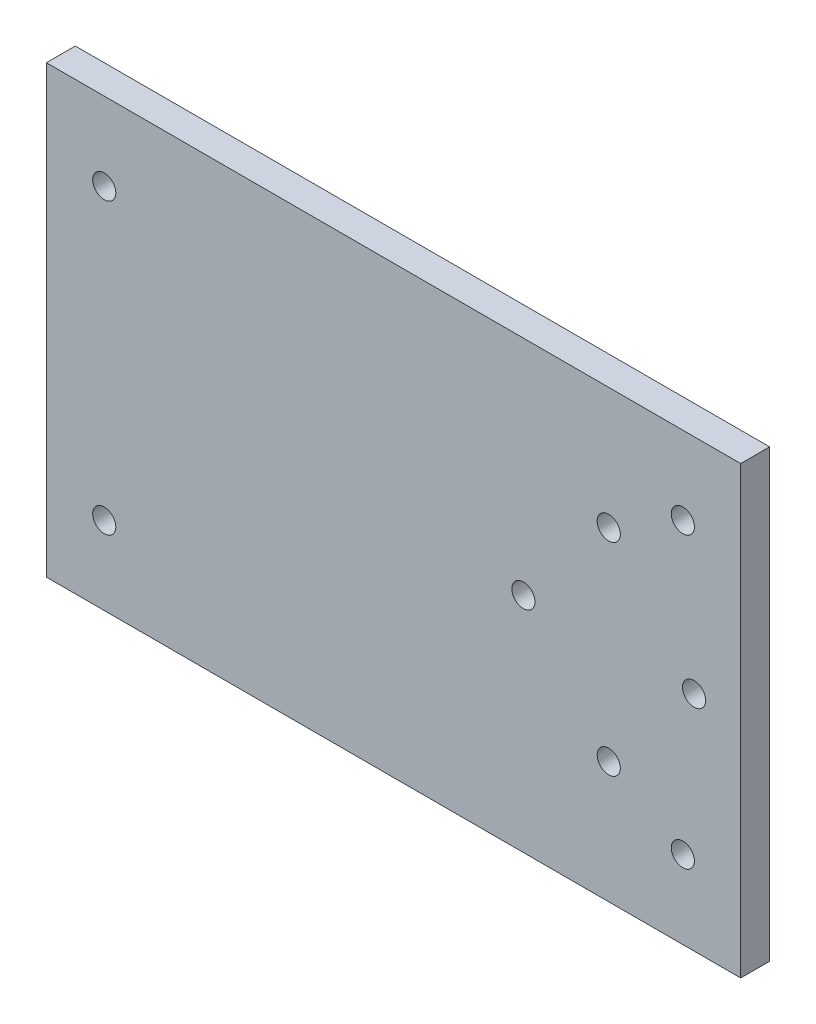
ISO-10303-21;
HEADER;
FILE_DESCRIPTION(('STEP AP214'),'2;1');
FILE_NAME('part.step','',(''),(''),'','','');
FILE_SCHEMA(('AUTOMOTIVE_DESIGN { 1 0 10303 214 1 1 1 1 }'));
ENDSEC;
DATA;
#1=APPLICATION_CONTEXT('core data for automotive mechanical design processes');
#2=APPLICATION_PROTOCOL_DEFINITION('international standard','automotive_design',2000,#1);
#3=PRODUCT_CONTEXT('',#1,'mechanical');
#4=PRODUCT('Part','Part','',(#3));
#5=PRODUCT_RELATED_PRODUCT_CATEGORY('part','',(#4));
#6=PRODUCT_DEFINITION_FORMATION('','',#4);
#7=PRODUCT_DEFINITION_CONTEXT('part definition',#1,'design');
#8=PRODUCT_DEFINITION('design','',#6,#7);
#9=PRODUCT_DEFINITION_SHAPE('','',#8);
#10=(LENGTH_UNIT() NAMED_UNIT(*) SI_UNIT(.MILLI.,.METRE.));
#11=(NAMED_UNIT(*) PLANE_ANGLE_UNIT() SI_UNIT($,.RADIAN.));
#12=(NAMED_UNIT(*) SI_UNIT($,.STERADIAN.) SOLID_ANGLE_UNIT());
#13=UNCERTAINTY_MEASURE_WITH_UNIT(LENGTH_MEASURE(1.E-05),#10,'distance_accuracy_value','');
#14=(GEOMETRIC_REPRESENTATION_CONTEXT(3) GLOBAL_UNCERTAINTY_ASSIGNED_CONTEXT((#13)) GLOBAL_UNIT_ASSIGNED_CONTEXT((#10,
#11,#12)) REPRESENTATION_CONTEXT('',''));
#15=CARTESIAN_POINT('',(0.,0.,0.));
#16=DIRECTION('',(0.,0.,1.));
#17=DIRECTION('',(1.,0.,0.));
#18=AXIS2_PLACEMENT_3D('',#15,#16,#17);
#19=CARTESIAN_POINT('',(0.,0.,10.));
#20=DIRECTION('',(1.,0.,0.));
#21=DIRECTION('',(0.,0.,-1.));
#22=AXIS2_PLACEMENT_3D('',#19,#20,#21);
#23=PLANE('',#22);
#24=DIRECTION('',(0.,-1.,0.));
#25=VECTOR('',#24,1.);
#26=CARTESIAN_POINT('',(0.,0.,0.));
#27=LINE('',#26,#25);
#28=CARTESIAN_POINT('',(0.,154.,0.));
#29=VERTEX_POINT('',#28);
#30=CARTESIAN_POINT('',(0.,0.,0.));
#31=VERTEX_POINT('',#30);
#32=EDGE_CURVE('E101',#29,#31,#27,.T.);
#33=ORIENTED_EDGE('',*,*,#32,.T.);
#34=DIRECTION('',(0.,0.,-1.));
#35=VECTOR('',#34,1.);
#36=CARTESIAN_POINT('',(0.,0.,10.));
#37=LINE('',#36,#35);
#38=CARTESIAN_POINT('',(0.,0.,10.));
#39=VERTEX_POINT('',#38);
#40=EDGE_CURVE('E92',#39,#31,#37,.T.);
#41=ORIENTED_EDGE('',*,*,#40,.F.);
#42=DIRECTION('',(0.,-1.,0.));
#43=VECTOR('',#42,1.);
#44=CARTESIAN_POINT('',(0.,0.,10.));
#45=LINE('',#44,#43);
#46=CARTESIAN_POINT('',(0.,154.,10.));
#47=VERTEX_POINT('',#46);
#48=EDGE_CURVE('E86',#47,#39,#45,.T.);
#49=ORIENTED_EDGE('',*,*,#48,.F.);
#50=DIRECTION('',(0.,0.,-1.));
#51=VECTOR('',#50,1.);
#52=CARTESIAN_POINT('',(0.,154.,10.));
#53=LINE('',#52,#51);
#54=EDGE_CURVE('E97',#47,#29,#53,.T.);
#55=ORIENTED_EDGE('',*,*,#54,.T.);
#56=EDGE_LOOP('',(#33,#41,#49,#55));
#57=FACE_BOUND('',#56,.T.);
#58=ADVANCED_FACE('F33',(#57),#23,.F.);
#59=CARTESIAN_POINT('',(0.,0.,10.));
#60=DIRECTION('',(0.,1.,0.));
#61=DIRECTION('',(0.,0.,1.));
#62=AXIS2_PLACEMENT_3D('',#59,#60,#61);
#63=PLANE('',#62);
#64=DIRECTION('',(1.,0.,0.));
#65=VECTOR('',#64,1.);
#66=CARTESIAN_POINT('',(0.,0.,0.));
#67=LINE('',#66,#65);
#68=CARTESIAN_POINT('',(240.,0.,0.));
#69=VERTEX_POINT('',#68);
#70=EDGE_CURVE('E91',#31,#69,#67,.T.);
#71=ORIENTED_EDGE('',*,*,#70,.T.);
#72=DIRECTION('',(0.,0.,-1.));
#73=VECTOR('',#72,1.);
#74=CARTESIAN_POINT('',(240.,0.,10.));
#75=LINE('',#74,#73);
#76=CARTESIAN_POINT('',(240.,0.,10.));
#77=VERTEX_POINT('',#76);
#78=EDGE_CURVE('E89',#77,#69,#75,.T.);
#79=ORIENTED_EDGE('',*,*,#78,.F.);
#80=DIRECTION('',(1.,0.,0.));
#81=VECTOR('',#80,1.);
#82=CARTESIAN_POINT('',(0.,0.,10.));
#83=LINE('',#82,#81);
#84=EDGE_CURVE('E81',#39,#77,#83,.T.);
#85=ORIENTED_EDGE('',*,*,#84,.F.);
#86=ORIENTED_EDGE('',*,*,#40,.T.);
#87=EDGE_LOOP('',(#71,#79,#85,#86));
#88=FACE_BOUND('',#87,.T.);
#89=ADVANCED_FACE('F90',(#88),#63,.F.);
#90=CARTESIAN_POINT('',(240.,0.,10.));
#91=DIRECTION('',(-1.,0.,0.));
#92=DIRECTION('',(0.,0.,1.));
#93=AXIS2_PLACEMENT_3D('',#90,#91,#92);
#94=PLANE('',#93);
#95=DIRECTION('',(0.,1.,0.));
#96=VECTOR('',#95,1.);
#97=CARTESIAN_POINT('',(240.,0.,0.));
#98=LINE('',#97,#96);
#99=CARTESIAN_POINT('',(240.,154.,0.));
#100=VERTEX_POINT('',#99);
#101=EDGE_CURVE('E67',#69,#100,#98,.T.);
#102=ORIENTED_EDGE('',*,*,#101,.T.);
#103=DIRECTION('',(0.,0.,-1.));
#104=VECTOR('',#103,1.);
#105=CARTESIAN_POINT('',(240.,154.,10.));
#106=LINE('',#105,#104);
#107=CARTESIAN_POINT('',(240.,154.,10.));
#108=VERTEX_POINT('',#107);
#109=EDGE_CURVE('E93',#108,#100,#106,.T.);
#110=ORIENTED_EDGE('',*,*,#109,.F.);
#111=DIRECTION('',(0.,1.,0.));
#112=VECTOR('',#111,1.);
#113=CARTESIAN_POINT('',(240.,0.,10.));
#114=LINE('',#113,#112);
#115=EDGE_CURVE('E84',#77,#108,#114,.T.);
#116=ORIENTED_EDGE('',*,*,#115,.F.);
#117=ORIENTED_EDGE('',*,*,#78,.T.);
#118=EDGE_LOOP('',(#102,#110,#116,#117));
#119=FACE_BOUND('',#118,.T.);
#120=ADVANCED_FACE('F95',(#119),#94,.F.);
#121=CARTESIAN_POINT('',(0.,154.,10.));
#122=DIRECTION('',(0.,-1.,0.));
#123=DIRECTION('',(0.,0.,-1.));
#124=AXIS2_PLACEMENT_3D('',#121,#122,#123);
#125=PLANE('',#124);
#126=DIRECTION('',(-1.,0.,0.));
#127=VECTOR('',#126,1.);
#128=CARTESIAN_POINT('',(0.,154.,0.));
#129=LINE('',#128,#127);
#130=EDGE_CURVE('E73',#100,#29,#129,.T.);
#131=ORIENTED_EDGE('',*,*,#130,.T.);
#132=ORIENTED_EDGE('',*,*,#54,.F.);
#133=DIRECTION('',(-1.,0.,0.));
#134=VECTOR('',#133,1.);
#135=CARTESIAN_POINT('',(0.,154.,10.));
#136=LINE('',#135,#134);
#137=EDGE_CURVE('E50',#108,#47,#136,.T.);
#138=ORIENTED_EDGE('',*,*,#137,.F.);
#139=ORIENTED_EDGE('',*,*,#109,.T.);
#140=EDGE_LOOP('',(#131,#132,#138,#139));
#141=FACE_BOUND('',#140,.T.);
#142=ADVANCED_FACE('F165',(#141),#125,.F.);
#143=CARTESIAN_POINT('',(0.,0.,10.));
#144=DIRECTION('',(0.,0.,-1.));
#145=DIRECTION('',(-1.,0.,0.));
#146=AXIS2_PLACEMENT_3D('',#143,#144,#145);
#147=PLANE('',#146);
#148=CARTESIAN_POINT('',(194.390000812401,42.0097909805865,10.));
#149=DIRECTION('',(0.,0.,1.));
#150=DIRECTION('',(1.,0.,0.));
#151=AXIS2_PLACEMENT_3D('',#148,#149,#150);
#152=CIRCLE('',#151,3.99999999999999);
#153=CARTESIAN_POINT('',(198.390000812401,42.0097909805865,10.));
#154=VERTEX_POINT('',#153);
#155=EDGE_CURVE('E205',#154,#154,#152,.T.);
#156=ORIENTED_EDGE('',*,*,#155,.F.);
#157=EDGE_LOOP('',(#156));
#158=FACE_BOUND('',#157,.T.);
#159=CARTESIAN_POINT('',(194.39,112.009790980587,10.));
#160=DIRECTION('',(0.,0.,1.));
#161=DIRECTION('',(1.,0.,0.));
#162=AXIS2_PLACEMENT_3D('',#159,#160,#161);
#163=CIRCLE('',#162,3.99999999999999);
#164=CARTESIAN_POINT('',(198.39,112.009790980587,10.));
#165=VERTEX_POINT('',#164);
#166=EDGE_CURVE('E202',#165,#165,#163,.T.);
#167=ORIENTED_EDGE('',*,*,#166,.F.);
#168=EDGE_LOOP('',(#167));
#169=FACE_BOUND('',#168,.T.);
#170=CARTESIAN_POINT('',(223.89,77.,10.));
#171=DIRECTION('',(0.,0.,1.));
#172=DIRECTION('',(1.,0.,0.));
#173=AXIS2_PLACEMENT_3D('',#170,#171,#172);
#174=CIRCLE('',#173,3.99999999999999);
#175=CARTESIAN_POINT('',(227.89,77.,10.));
#176=VERTEX_POINT('',#175);
#177=EDGE_CURVE('E204',#176,#176,#174,.T.);
#178=ORIENTED_EDGE('',*,*,#177,.F.);
#179=EDGE_LOOP('',(#178));
#180=FACE_BOUND('',#179,.T.);
#181=CARTESIAN_POINT('',(164.890000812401,77.0097909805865,10.));
#182=DIRECTION('',(0.,0.,1.));
#183=DIRECTION('',(1.,0.,0.));
#184=AXIS2_PLACEMENT_3D('',#181,#182,#183);
#185=CIRCLE('',#184,3.99999999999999);
#186=CARTESIAN_POINT('',(168.890000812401,77.0097909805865,10.));
#187=VERTEX_POINT('',#186);
#188=EDGE_CURVE('E208',#187,#187,#185,.T.);
#189=ORIENTED_EDGE('',*,*,#188,.F.);
#190=EDGE_LOOP('',(#189));
#191=FACE_BOUND('',#190,.T.);
#192=CARTESIAN_POINT('',(220.,127.,10.));
#193=DIRECTION('',(0.,0.,1.));
#194=DIRECTION('',(1.,0.,0.));
#195=AXIS2_PLACEMENT_3D('',#192,#193,#194);
#196=CIRCLE('',#195,3.99999999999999);
#197=CARTESIAN_POINT('',(224.,127.,10.));
#198=VERTEX_POINT('',#197);
#199=EDGE_CURVE('E215',#198,#198,#196,.T.);
#200=ORIENTED_EDGE('',*,*,#199,.F.);
#201=EDGE_LOOP('',(#200));
#202=FACE_BOUND('',#201,.T.);
#203=CARTESIAN_POINT('',(220.,27.,10.));
#204=DIRECTION('',(0.,0.,1.));
#205=DIRECTION('',(1.,0.,0.));
#206=AXIS2_PLACEMENT_3D('',#203,#204,#205);
#207=CIRCLE('',#206,3.99999999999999);
#208=CARTESIAN_POINT('',(224.,27.,10.));
#209=VERTEX_POINT('',#208);
#210=EDGE_CURVE('E217',#209,#209,#207,.T.);
#211=ORIENTED_EDGE('',*,*,#210,.F.);
#212=EDGE_LOOP('',(#211));
#213=FACE_BOUND('',#212,.T.);
#214=CARTESIAN_POINT('',(20.,127.,10.));
#215=DIRECTION('',(0.,0.,1.));
#216=DIRECTION('',(1.,0.,0.));
#217=AXIS2_PLACEMENT_3D('',#214,#215,#216);
#218=CIRCLE('',#217,4.);
#219=CARTESIAN_POINT('',(24.,127.,10.));
#220=VERTEX_POINT('',#219);
#221=EDGE_CURVE('E221',#220,#220,#218,.T.);
#222=ORIENTED_EDGE('',*,*,#221,.F.);
#223=EDGE_LOOP('',(#222));
#224=FACE_BOUND('',#223,.T.);
#225=CARTESIAN_POINT('',(20.,27.,10.));
#226=DIRECTION('',(0.,0.,1.));
#227=DIRECTION('',(1.,0.,0.));
#228=AXIS2_PLACEMENT_3D('',#225,#226,#227);
#229=CIRCLE('',#228,4.);
#230=CARTESIAN_POINT('',(24.,27.,10.));
#231=VERTEX_POINT('',#230);
#232=EDGE_CURVE('E225',#231,#231,#229,.T.);
#233=ORIENTED_EDGE('',*,*,#232,.F.);
#234=EDGE_LOOP('',(#233));
#235=FACE_BOUND('',#234,.T.);
#236=ORIENTED_EDGE('',*,*,#48,.T.);
#237=ORIENTED_EDGE('',*,*,#84,.T.);
#238=ORIENTED_EDGE('',*,*,#115,.T.);
#239=ORIENTED_EDGE('',*,*,#137,.T.);
#240=EDGE_LOOP('',(#236,#237,#238,#239));
#241=FACE_BOUND('',#240,.T.);
#242=ADVANCED_FACE('F82',(#158,#169,#180,#191,#202,#213,#224,#235,#241),#147,.F.);
#243=CARTESIAN_POINT('',(0.,0.,0.));
#244=DIRECTION('',(0.,0.,-1.));
#245=DIRECTION('',(-1.,0.,0.));
#246=AXIS2_PLACEMENT_3D('',#243,#244,#245);
#247=PLANE('',#246);
#248=CARTESIAN_POINT('',(164.890000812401,77.0097909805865,0.));
#249=DIRECTION('',(0.,0.,-1.));
#250=DIRECTION('',(-1.,0.,0.));
#251=AXIS2_PLACEMENT_3D('',#248,#249,#250);
#252=CIRCLE('',#251,7.00000000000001);
#253=CARTESIAN_POINT('',(157.890000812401,77.0097909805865,0.));
#254=VERTEX_POINT('',#253);
#255=EDGE_CURVE('E120',#254,#254,#252,.F.);
#256=ORIENTED_EDGE('',*,*,#255,.T.);
#257=EDGE_LOOP('',(#256));
#258=FACE_BOUND('',#257,.T.);
#259=CARTESIAN_POINT('',(194.39,112.009790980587,0.));
#260=DIRECTION('',(0.,0.,-1.));
#261=DIRECTION('',(-1.,0.,0.));
#262=AXIS2_PLACEMENT_3D('',#259,#260,#261);
#263=CIRCLE('',#262,7.00000000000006);
#264=CARTESIAN_POINT('',(187.39,112.009790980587,0.));
#265=VERTEX_POINT('',#264);
#266=EDGE_CURVE('E117',#265,#265,#263,.F.);
#267=ORIENTED_EDGE('',*,*,#266,.T.);
#268=EDGE_LOOP('',(#267));
#269=FACE_BOUND('',#268,.T.);
#270=CARTESIAN_POINT('',(223.89,77.,0.));
#271=DIRECTION('',(0.,0.,-1.));
#272=DIRECTION('',(-1.,0.,0.));
#273=AXIS2_PLACEMENT_3D('',#270,#271,#272);
#274=CIRCLE('',#273,7.00000000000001);
#275=CARTESIAN_POINT('',(216.89,77.,0.));
#276=VERTEX_POINT('',#275);
#277=EDGE_CURVE('E114',#276,#276,#274,.F.);
#278=ORIENTED_EDGE('',*,*,#277,.T.);
#279=EDGE_LOOP('',(#278));
#280=FACE_BOUND('',#279,.T.);
#281=CARTESIAN_POINT('',(194.390000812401,42.0097909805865,0.));
#282=DIRECTION('',(0.,0.,-1.));
#283=DIRECTION('',(-1.,0.,0.));
#284=AXIS2_PLACEMENT_3D('',#281,#282,#283);
#285=CIRCLE('',#284,7.00000000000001);
#286=CARTESIAN_POINT('',(187.390000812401,42.0097909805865,0.));
#287=VERTEX_POINT('',#286);
#288=EDGE_CURVE('E111',#287,#287,#285,.F.);
#289=ORIENTED_EDGE('',*,*,#288,.T.);
#290=EDGE_LOOP('',(#289));
#291=FACE_BOUND('',#290,.T.);
#292=CARTESIAN_POINT('',(220.,127.,0.));
#293=DIRECTION('',(0.,0.,1.));
#294=DIRECTION('',(1.,0.,0.));
#295=AXIS2_PLACEMENT_3D('',#292,#293,#294);
#296=CIRCLE('',#295,3.99999999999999);
#297=CARTESIAN_POINT('',(224.,127.,0.));
#298=VERTEX_POINT('',#297);
#299=EDGE_CURVE('E151',#298,#298,#296,.T.);
#300=ORIENTED_EDGE('',*,*,#299,.T.);
#301=EDGE_LOOP('',(#300));
#302=FACE_BOUND('',#301,.T.);
#303=CARTESIAN_POINT('',(220.,27.,0.));
#304=DIRECTION('',(0.,0.,1.));
#305=DIRECTION('',(1.,0.,0.));
#306=AXIS2_PLACEMENT_3D('',#303,#304,#305);
#307=CIRCLE('',#306,3.99999999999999);
#308=CARTESIAN_POINT('',(224.,27.,0.));
#309=VERTEX_POINT('',#308);
#310=EDGE_CURVE('E155',#309,#309,#307,.T.);
#311=ORIENTED_EDGE('',*,*,#310,.T.);
#312=EDGE_LOOP('',(#311));
#313=FACE_BOUND('',#312,.T.);
#314=CARTESIAN_POINT('',(20.,127.,0.));
#315=DIRECTION('',(0.,0.,1.));
#316=DIRECTION('',(1.,0.,0.));
#317=AXIS2_PLACEMENT_3D('',#314,#315,#316);
#318=CIRCLE('',#317,4.);
#319=CARTESIAN_POINT('',(24.,127.,0.));
#320=VERTEX_POINT('',#319);
#321=EDGE_CURVE('E159',#320,#320,#318,.T.);
#322=ORIENTED_EDGE('',*,*,#321,.T.);
#323=EDGE_LOOP('',(#322));
#324=FACE_BOUND('',#323,.T.);
#325=CARTESIAN_POINT('',(20.,27.,0.));
#326=DIRECTION('',(0.,0.,1.));
#327=DIRECTION('',(1.,0.,0.));
#328=AXIS2_PLACEMENT_3D('',#325,#326,#327);
#329=CIRCLE('',#328,4.);
#330=CARTESIAN_POINT('',(24.,27.,0.));
#331=VERTEX_POINT('',#330);
#332=EDGE_CURVE('E104',#331,#331,#329,.T.);
#333=ORIENTED_EDGE('',*,*,#332,.T.);
#334=EDGE_LOOP('',(#333));
#335=FACE_BOUND('',#334,.T.);
#336=ORIENTED_EDGE('',*,*,#32,.F.);
#337=ORIENTED_EDGE('',*,*,#130,.F.);
#338=ORIENTED_EDGE('',*,*,#101,.F.);
#339=ORIENTED_EDGE('',*,*,#70,.F.);
#340=EDGE_LOOP('',(#336,#337,#338,#339));
#341=FACE_BOUND('',#340,.T.);
#342=ADVANCED_FACE('F140',(#258,#269,#280,#291,#302,#313,#324,#335,#341),#247,.T.);
#343=CARTESIAN_POINT('',(20.,27.,0.));
#344=DIRECTION('',(0.,0.,1.));
#345=DIRECTION('',(1.,0.,0.));
#346=AXIS2_PLACEMENT_3D('',#343,#344,#345);
#347=CYLINDRICAL_SURFACE('',#346,4.);
#348=ORIENTED_EDGE('',*,*,#332,.F.);
#349=EDGE_LOOP('',(#348));
#350=FACE_BOUND('',#349,.T.);
#351=ORIENTED_EDGE('',*,*,#232,.T.);
#352=EDGE_LOOP('',(#351));
#353=FACE_BOUND('',#352,.T.);
#354=ADVANCED_FACE('F143',(#350,#353),#347,.F.);
#355=CARTESIAN_POINT('',(20.,127.,0.));
#356=DIRECTION('',(0.,0.,1.));
#357=DIRECTION('',(1.,0.,0.));
#358=AXIS2_PLACEMENT_3D('',#355,#356,#357);
#359=CYLINDRICAL_SURFACE('',#358,4.);
#360=ORIENTED_EDGE('',*,*,#321,.F.);
#361=EDGE_LOOP('',(#360));
#362=FACE_BOUND('',#361,.T.);
#363=ORIENTED_EDGE('',*,*,#221,.T.);
#364=EDGE_LOOP('',(#363));
#365=FACE_BOUND('',#364,.T.);
#366=ADVANCED_FACE('F234',(#362,#365),#359,.F.);
#367=CARTESIAN_POINT('',(220.,27.,0.));
#368=DIRECTION('',(0.,0.,1.));
#369=DIRECTION('',(1.,0.,0.));
#370=AXIS2_PLACEMENT_3D('',#367,#368,#369);
#371=CYLINDRICAL_SURFACE('',#370,3.99999999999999);
#372=ORIENTED_EDGE('',*,*,#310,.F.);
#373=EDGE_LOOP('',(#372));
#374=FACE_BOUND('',#373,.T.);
#375=ORIENTED_EDGE('',*,*,#210,.T.);
#376=EDGE_LOOP('',(#375));
#377=FACE_BOUND('',#376,.T.);
#378=ADVANCED_FACE('F240',(#374,#377),#371,.F.);
#379=CARTESIAN_POINT('',(220.,127.,0.));
#380=DIRECTION('',(0.,0.,1.));
#381=DIRECTION('',(1.,0.,0.));
#382=AXIS2_PLACEMENT_3D('',#379,#380,#381);
#383=CYLINDRICAL_SURFACE('',#382,3.99999999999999);
#384=ORIENTED_EDGE('',*,*,#299,.F.);
#385=EDGE_LOOP('',(#384));
#386=FACE_BOUND('',#385,.T.);
#387=ORIENTED_EDGE('',*,*,#199,.T.);
#388=EDGE_LOOP('',(#387));
#389=FACE_BOUND('',#388,.T.);
#390=ADVANCED_FACE('F246',(#386,#389),#383,.F.);
#391=CARTESIAN_POINT('',(164.890000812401,77.0097909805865,0.));
#392=DIRECTION('',(0.,0.,1.));
#393=DIRECTION('',(1.,0.,0.));
#394=AXIS2_PLACEMENT_3D('',#391,#392,#393);
#395=CYLINDRICAL_SURFACE('',#394,3.99999999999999);
#396=CARTESIAN_POINT('',(164.890000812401,77.0097909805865,2.99999999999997));
#397=DIRECTION('',(0.,0.,-1.));
#398=DIRECTION('',(-1.,0.,0.));
#399=AXIS2_PLACEMENT_3D('',#396,#397,#398);
#400=CIRCLE('',#399,3.99999999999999);
#401=CARTESIAN_POINT('',(160.890000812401,77.0097909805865,2.99999999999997));
#402=VERTEX_POINT('',#401);
#403=EDGE_CURVE('E123',#402,#402,#400,.T.);
#404=ORIENTED_EDGE('',*,*,#403,.T.);
#405=EDGE_LOOP('',(#404));
#406=FACE_BOUND('',#405,.T.);
#407=ORIENTED_EDGE('',*,*,#188,.T.);
#408=EDGE_LOOP('',(#407));
#409=FACE_BOUND('',#408,.T.);
#410=ADVANCED_FACE('F250',(#406,#409),#395,.F.);
#411=CARTESIAN_POINT('',(223.89,77.,0.));
#412=DIRECTION('',(0.,0.,1.));
#413=DIRECTION('',(1.,0.,0.));
#414=AXIS2_PLACEMENT_3D('',#411,#412,#413);
#415=CYLINDRICAL_SURFACE('',#414,3.99999999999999);
#416=CARTESIAN_POINT('',(223.89,77.,2.99999999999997));
#417=DIRECTION('',(0.,0.,-1.));
#418=DIRECTION('',(-1.,0.,0.));
#419=AXIS2_PLACEMENT_3D('',#416,#417,#418);
#420=CIRCLE('',#419,3.99999999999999);
#421=CARTESIAN_POINT('',(219.89,77.,2.99999999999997));
#422=VERTEX_POINT('',#421);
#423=EDGE_CURVE('E42',#422,#422,#420,.T.);
#424=ORIENTED_EDGE('',*,*,#423,.T.);
#425=EDGE_LOOP('',(#424));
#426=FACE_BOUND('',#425,.T.);
#427=ORIENTED_EDGE('',*,*,#177,.T.);
#428=EDGE_LOOP('',(#427));
#429=FACE_BOUND('',#428,.T.);
#430=ADVANCED_FACE('F131',(#426,#429),#415,.F.);
#431=CARTESIAN_POINT('',(194.39,112.009790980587,0.));
#432=DIRECTION('',(0.,0.,1.));
#433=DIRECTION('',(1.,0.,0.));
#434=AXIS2_PLACEMENT_3D('',#431,#432,#433);
#435=CYLINDRICAL_SURFACE('',#434,3.99999999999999);
#436=CARTESIAN_POINT('',(194.39,112.009790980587,3.00000000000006));
#437=DIRECTION('',(0.,0.,-1.));
#438=DIRECTION('',(-1.,0.,0.));
#439=AXIS2_PLACEMENT_3D('',#436,#437,#438);
#440=CIRCLE('',#439,3.99999999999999);
#441=CARTESIAN_POINT('',(190.39,112.009790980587,3.00000000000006));
#442=VERTEX_POINT('',#441);
#443=EDGE_CURVE('E126',#442,#442,#440,.T.);
#444=ORIENTED_EDGE('',*,*,#443,.T.);
#445=EDGE_LOOP('',(#444));
#446=FACE_BOUND('',#445,.T.);
#447=ORIENTED_EDGE('',*,*,#166,.T.);
#448=EDGE_LOOP('',(#447));
#449=FACE_BOUND('',#448,.T.);
#450=ADVANCED_FACE('F196',(#446,#449),#435,.F.);
#451=CARTESIAN_POINT('',(194.390000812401,42.0097909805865,0.));
#452=DIRECTION('',(0.,0.,1.));
#453=DIRECTION('',(1.,0.,0.));
#454=AXIS2_PLACEMENT_3D('',#451,#452,#453);
#455=CYLINDRICAL_SURFACE('',#454,3.99999999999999);
#456=CARTESIAN_POINT('',(194.390000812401,42.0097909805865,2.99999999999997));
#457=DIRECTION('',(0.,0.,-1.));
#458=DIRECTION('',(-1.,0.,0.));
#459=AXIS2_PLACEMENT_3D('',#456,#457,#458);
#460=CIRCLE('',#459,3.99999999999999);
#461=CARTESIAN_POINT('',(190.390000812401,42.0097909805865,2.99999999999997));
#462=VERTEX_POINT('',#461);
#463=EDGE_CURVE('E11',#462,#462,#460,.T.);
#464=ORIENTED_EDGE('',*,*,#463,.T.);
#465=EDGE_LOOP('',(#464));
#466=FACE_BOUND('',#465,.T.);
#467=ORIENTED_EDGE('',*,*,#155,.T.);
#468=EDGE_LOOP('',(#467));
#469=FACE_BOUND('',#468,.T.);
#470=ADVANCED_FACE('F185',(#466,#469),#455,.F.);
#471=CARTESIAN_POINT('',(164.890000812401,77.0097909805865,0.));
#472=DIRECTION('',(0.,0.,-1.));
#473=DIRECTION('',(-1.,0.,0.));
#474=AXIS2_PLACEMENT_3D('',#471,#472,#473);
#475=CONICAL_SURFACE('',#474,7.00000000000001,0.785398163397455);
#476=ORIENTED_EDGE('',*,*,#403,.F.);
#477=EDGE_LOOP('',(#476));
#478=FACE_BOUND('',#477,.T.);
#479=ORIENTED_EDGE('',*,*,#255,.F.);
#480=EDGE_LOOP('',(#479));
#481=FACE_BOUND('',#480,.T.);
#482=ADVANCED_FACE('F182',(#478,#481),#475,.F.);
#483=CARTESIAN_POINT('',(194.39,112.009790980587,0.));
#484=DIRECTION('',(0.,0.,-1.));
#485=DIRECTION('',(-1.,0.,0.));
#486=AXIS2_PLACEMENT_3D('',#483,#484,#485);
#487=CONICAL_SURFACE('',#486,7.00000000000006,0.785398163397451);
#488=CARTESIAN_POINT('',(190.39,112.009790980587,3.00000000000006));
#489=CARTESIAN_POINT('',(190.35875,112.009790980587,2.96875000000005));
#490=CARTESIAN_POINT('',(190.3275,112.009790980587,2.93750000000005));
#491=CARTESIAN_POINT('',(190.265,112.009790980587,2.87500000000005));
#492=CARTESIAN_POINT('',(190.23375,112.009790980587,2.84375000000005));
#493=CARTESIAN_POINT('',(190.17125,112.009790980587,2.78125000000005));
#494=CARTESIAN_POINT('',(190.14,112.009790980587,2.75000000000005));
#495=CARTESIAN_POINT('',(190.0775,112.009790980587,2.68750000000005));
#496=CARTESIAN_POINT('',(190.04625,112.009790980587,2.65625000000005));
#497=CARTESIAN_POINT('',(189.98375,112.009790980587,2.59375000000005));
#498=CARTESIAN_POINT('',(189.9525,112.009790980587,2.56250000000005));
#499=CARTESIAN_POINT('',(189.89,112.009790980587,2.50000000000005));
#500=CARTESIAN_POINT('',(189.85875,112.009790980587,2.46875000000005));
#501=CARTESIAN_POINT('',(189.79625,112.009790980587,2.40625000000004));
#502=CARTESIAN_POINT('',(189.765,112.009790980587,2.37500000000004));
#503=CARTESIAN_POINT('',(189.7025,112.009790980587,2.31250000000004));
#504=CARTESIAN_POINT('',(189.67125,112.009790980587,2.28125000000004));
#505=CARTESIAN_POINT('',(189.60875,112.009790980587,2.21875000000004));
#506=CARTESIAN_POINT('',(189.5775,112.009790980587,2.18750000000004));
#507=CARTESIAN_POINT('',(189.515,112.009790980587,2.12500000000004));
#508=CARTESIAN_POINT('',(189.48375,112.009790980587,2.09375000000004));
#509=CARTESIAN_POINT('',(189.42125,112.009790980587,2.03125000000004));
#510=CARTESIAN_POINT('',(189.39,112.009790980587,2.00000000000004));
#511=CARTESIAN_POINT('',(189.3275,112.009790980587,1.93750000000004));
#512=CARTESIAN_POINT('',(189.29625,112.009790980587,1.90625000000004));
#513=CARTESIAN_POINT('',(189.23375,112.009790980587,1.84375000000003));
#514=CARTESIAN_POINT('',(189.2025,112.009790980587,1.81250000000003));
#515=CARTESIAN_POINT('',(189.14,112.009790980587,1.75000000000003));
#516=CARTESIAN_POINT('',(189.10875,112.009790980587,1.71875000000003));
#517=CARTESIAN_POINT('',(189.04625,112.009790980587,1.65625000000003));
#518=CARTESIAN_POINT('',(189.015,112.009790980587,1.62500000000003));
#519=CARTESIAN_POINT('',(188.9525,112.009790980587,1.56250000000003));
#520=CARTESIAN_POINT('',(188.92125,112.009790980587,1.53125000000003));
#521=CARTESIAN_POINT('',(188.85875,112.009790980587,1.46875000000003));
#522=CARTESIAN_POINT('',(188.8275,112.009790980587,1.43750000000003));
#523=CARTESIAN_POINT('',(188.765,112.009790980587,1.37500000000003));
#524=CARTESIAN_POINT('',(188.73375,112.009790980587,1.34375000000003));
#525=CARTESIAN_POINT('',(188.67125,112.009790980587,1.28125000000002));
#526=CARTESIAN_POINT('',(188.64,112.009790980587,1.25000000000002));
#527=CARTESIAN_POINT('',(188.5775,112.009790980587,1.18750000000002));
#528=CARTESIAN_POINT('',(188.54625,112.009790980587,1.15625000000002));
#529=CARTESIAN_POINT('',(188.48375,112.009790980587,1.09375000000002));
#530=CARTESIAN_POINT('',(188.4525,112.009790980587,1.06250000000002));
#531=CARTESIAN_POINT('',(188.39,112.009790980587,1.00000000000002));
#532=CARTESIAN_POINT('',(188.35875,112.009790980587,0.968750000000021));
#533=CARTESIAN_POINT('',(188.29625,112.009790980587,0.906250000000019));
#534=CARTESIAN_POINT('',(188.265,112.009790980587,0.875000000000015));
#535=CARTESIAN_POINT('',(188.2025,112.009790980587,0.812500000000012));
#536=CARTESIAN_POINT('',(188.17125,112.009790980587,0.781250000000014));
#537=CARTESIAN_POINT('',(188.10875,112.009790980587,0.718750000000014));
#538=CARTESIAN_POINT('',(188.0775,112.009790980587,0.687500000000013));
#539=CARTESIAN_POINT('',(188.015,112.009790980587,0.625000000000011));
#540=CARTESIAN_POINT('',(187.98375,112.009790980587,0.593750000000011));
#541=CARTESIAN_POINT('',(187.92125,112.009790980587,0.53125000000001));
#542=CARTESIAN_POINT('',(187.89,112.009790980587,0.500000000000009));
#543=CARTESIAN_POINT('',(187.8275,112.009790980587,0.437500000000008));
#544=CARTESIAN_POINT('',(187.79625,112.009790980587,0.406250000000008));
#545=CARTESIAN_POINT('',(187.73375,112.009790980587,0.343750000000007));
#546=CARTESIAN_POINT('',(187.7025,112.009790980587,0.312500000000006));
#547=CARTESIAN_POINT('',(187.64,112.009790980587,0.250000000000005));
#548=CARTESIAN_POINT('',(187.60875,112.009790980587,0.218750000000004));
#549=CARTESIAN_POINT('',(187.54625,112.009790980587,0.156250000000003));
#550=CARTESIAN_POINT('',(187.515,112.009790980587,0.125000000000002));
#551=CARTESIAN_POINT('',(187.4525,112.009790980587,0.0625000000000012));
#552=CARTESIAN_POINT('',(187.42125,112.009790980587,0.0312500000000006));
#553=CARTESIAN_POINT('',(187.39,112.009790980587,0.));
#554=B_SPLINE_CURVE_WITH_KNOTS('',3,(#488,#489,#490,#491,#492,#493,#494,#495,#496,#497,#498,
#499,#500,#501,#502,#503,#504,#505,#506,#507,#508,#509,#510,#511,#512,#513,#514,#515,#516,#517,
#518,#519,#520,#521,#522,#523,#524,#525,#526,#527,#528,#529,#530,#531,#532,#533,#534,#535,#536,
#537,#538,#539,#540,#541,#542,#543,#544,#545,#546,#547,#548,#549,#550,#551,#552,#553),
.UNSPECIFIED.,.F.,.F.,(4,2,2,2,2,2,2,2,2,2,2,2,2,2,2,2,2,2,2,2,2,2,2,2,2,2,2,2,2,2,2,2,4),(0.,
0.132582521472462,0.265165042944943,0.397747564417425,0.530330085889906,0.662912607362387,
0.795495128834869,0.928077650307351,1.06066017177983,1.19324269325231,1.3258252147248,
1.45840773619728,1.59099025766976,1.72357277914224,1.85615530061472,1.9887378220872,
2.12132034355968,2.25390286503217,2.38648538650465,2.51906790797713,2.65165042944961,
2.78423295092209,2.91681547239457,3.04939799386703,3.18198051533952,3.314563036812,
3.44714555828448,3.57972807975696,3.71231060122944,3.84489312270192,3.97747564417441,
4.11005816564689,4.24264068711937),.UNSPECIFIED.);
#555=EDGE_CURVE('BSEAM137',#442,#265,#554,.T.);
#556=ORIENTED_EDGE('',*,*,#443,.F.);
#557=ORIENTED_EDGE('',*,*,#266,.F.);
#558=ORIENTED_EDGE('',*,*,#555,.T.);
#559=ORIENTED_EDGE('',*,*,#555,.F.);
#560=EDGE_LOOP('',(#556,#558,#557,#559));
#561=FACE_BOUND('',#560,.T.);
#562=ADVANCED_FACE('F137',(#561),#487,.F.);
#563=CARTESIAN_POINT('',(223.89,77.,0.));
#564=DIRECTION('',(0.,0.,-1.));
#565=DIRECTION('',(-1.,0.,0.));
#566=AXIS2_PLACEMENT_3D('',#563,#564,#565);
#567=CONICAL_SURFACE('',#566,7.00000000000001,0.785398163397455);
#568=ORIENTED_EDGE('',*,*,#423,.F.);
#569=EDGE_LOOP('',(#568));
#570=FACE_BOUND('',#569,.T.);
#571=ORIENTED_EDGE('',*,*,#277,.F.);
#572=EDGE_LOOP('',(#571));
#573=FACE_BOUND('',#572,.T.);
#574=ADVANCED_FACE('F134',(#570,#573),#567,.F.);
#575=CARTESIAN_POINT('',(194.390000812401,42.0097909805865,0.));
#576=DIRECTION('',(0.,0.,-1.));
#577=DIRECTION('',(-1.,0.,0.));
#578=AXIS2_PLACEMENT_3D('',#575,#576,#577);
#579=CONICAL_SURFACE('',#578,7.00000000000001,0.785398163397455);
#580=ORIENTED_EDGE('',*,*,#463,.F.);
#581=EDGE_LOOP('',(#580));
#582=FACE_BOUND('',#581,.T.);
#583=ORIENTED_EDGE('',*,*,#288,.F.);
#584=EDGE_LOOP('',(#583));
#585=FACE_BOUND('',#584,.T.);
#586=ADVANCED_FACE('F35',(#582,#585),#579,.F.);
#587=CLOSED_SHELL('',(#58,#89,#120,#142,#242,#342,#354,#366,#378,#390,#410,#430,#450,#470,#482,
#562,#574,#586));
#588=MANIFOLD_SOLID_BREP('B2',#587);
#589=ADVANCED_BREP_SHAPE_REPRESENTATION('',(#18,#588),#14);
#590=SHAPE_DEFINITION_REPRESENTATION(#9,#589);
ENDSEC;
END-ISO-10303-21;
